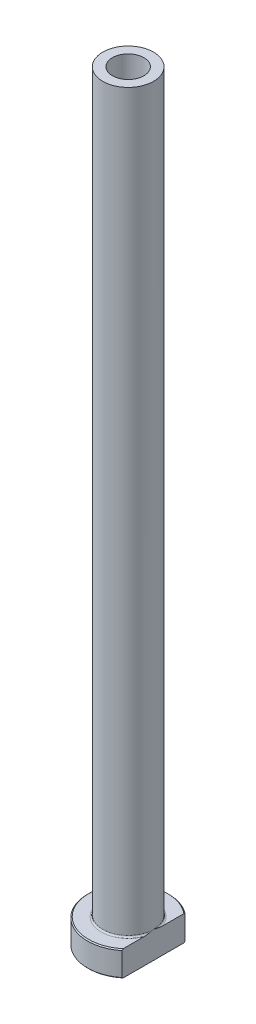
from build123d import *

# Parameters (mm, degrees)
FILLET1_R          = 0.3
CHAMFER1_SIZE      = 0.2
CUT_EXTRUDE1_DEPTH = 151.426061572
CHAMFER2_SIZE      = 0.5


with BuildPart() as part:
    # Sketch1 → Revolve1 (revolve)
    with BuildSketch(Plane.XY, mode=Mode.PRIVATE) as revolve1_sk:
        Polygon((-3.1, 150), (-5, 150), (-5, 5), (-8, 5), (-8, 0), (-3.35, 0), (-3.35, 93), (-3.1, 105), align=None)
    revolve(revolve1_sk.sketch.rotate(Axis((0, 92.187680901, 0), (0, -1, 0)), 270), axis=Axis((0, 92.187680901, 0), (0, -1, 0)))

    # Fillet1
    fillet1_edges = [part.edges().sort_by_distance(p)[0] for p in [
        (0, 5, -5),
    ]]
    fillet(fillet1_edges, radius=FILLET1_R)

    # Chamfer1
    chamfer1_edges = [part.edges().sort_by_distance(p)[0] for p in [
        (0, 0, -8),
        (0, 5, -8),
    ]]
    chamfer(chamfer1_edges, length=CHAMFER1_SIZE)

    # Sketch2 → Cut-Extrude1 (cut, through all)
    with BuildSketch(Plane.XZ):
        with BuildLine():
            Line((5, 6.244997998), (5, -6.244997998))
            ThreePointArc((5, -6.244997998), (8, 0), (5, 6.244997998))
        make_face()
    extrude(amount=-CUT_EXTRUDE1_DEPTH, mode=Mode.SUBTRACT)

    # Chamfer2
    chamfer2_edges = [part.edges().sort_by_distance(p)[0] for p in [
        (0, 0, -3.35),
    ]]
    chamfer(chamfer2_edges, length=CHAMFER2_SIZE)


solid = part.part
